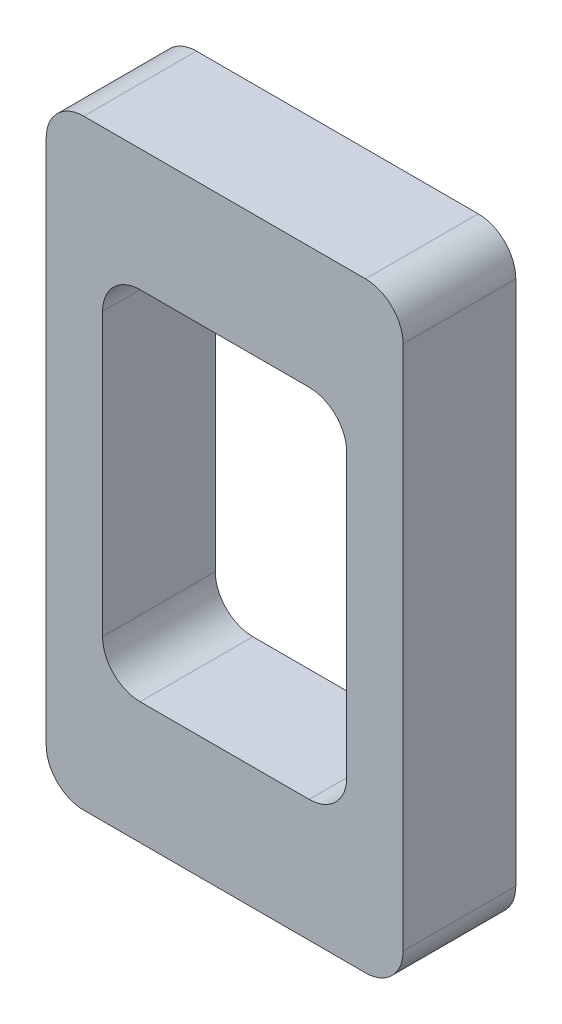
from build123d import *

# Parameters (mm, degrees)
ESQUISSE1_W      = 9.5
ESQUISSE1_H      = 16
ESQUISSE1_W_2    = 6.5
ESQUISSE1_H_2    = 9.5
EXTRUSION1_DEPTH = 3
CONG_1_R         = 1


with BuildPart() as part:
    # Esquisse1 → Extrusion1 (new body)
    with BuildSketch(Plane.XY):
        with Locations((-55.8, 37.58978076)):
            Rectangle(ESQUISSE1_W, ESQUISSE1_H)
        with Locations((-55.8, 37.58978076)):
            Rectangle(ESQUISSE1_W_2, ESQUISSE1_H_2, mode=Mode.SUBTRACT)
    extrude(amount=EXTRUSION1_DEPTH)

    # Cong_1
    cong_1_edges = [part.edges().sort_by_distance(p)[0] for p in [
        (-59.05, 32.83978076, 1.5),
        (-52.55, 32.83978076, 1.5),
        (-52.55, 42.33978076, 1.5),
        (-59.05, 42.33978076, 1.5),
        (-51.05, 45.58978076, 1.5),
        (-51.05, 29.58978076, 1.5),
        (-60.55, 29.58978076, 1.5),
        (-60.55, 45.58978076, 1.5),
    ]]
    fillet(cong_1_edges, radius=CONG_1_R)


solid = part.part
